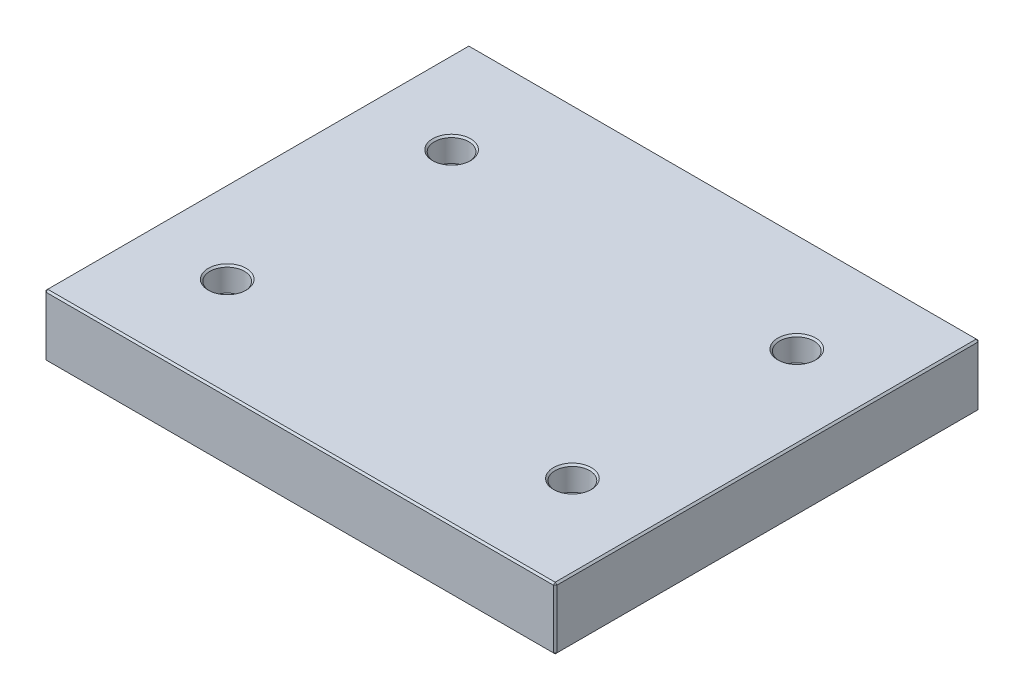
ISO-10303-21;
HEADER;
FILE_DESCRIPTION(('STEP AP214'),'2;1');
FILE_NAME('part.step','',(''),(''),'','','');
FILE_SCHEMA(('AUTOMOTIVE_DESIGN { 1 0 10303 214 1 1 1 1 }'));
ENDSEC;
DATA;
#1=APPLICATION_CONTEXT('core data for automotive mechanical design processes');
#2=APPLICATION_PROTOCOL_DEFINITION('international standard','automotive_design',2000,#1);
#3=PRODUCT_CONTEXT('',#1,'mechanical');
#4=PRODUCT('Part','Part','',(#3));
#5=PRODUCT_RELATED_PRODUCT_CATEGORY('part','',(#4));
#6=PRODUCT_DEFINITION_FORMATION('','',#4);
#7=PRODUCT_DEFINITION_CONTEXT('part definition',#1,'design');
#8=PRODUCT_DEFINITION('design','',#6,#7);
#9=PRODUCT_DEFINITION_SHAPE('','',#8);
#10=(LENGTH_UNIT() NAMED_UNIT(*) SI_UNIT(.MILLI.,.METRE.));
#11=(NAMED_UNIT(*) PLANE_ANGLE_UNIT() SI_UNIT($,.RADIAN.));
#12=(NAMED_UNIT(*) SI_UNIT($,.STERADIAN.) SOLID_ANGLE_UNIT());
#13=UNCERTAINTY_MEASURE_WITH_UNIT(LENGTH_MEASURE(1.E-05),#10,'distance_accuracy_value','');
#14=(GEOMETRIC_REPRESENTATION_CONTEXT(3) GLOBAL_UNCERTAINTY_ASSIGNED_CONTEXT((#13)) GLOBAL_UNIT_ASSIGNED_CONTEXT((#10,
#11,#12)) REPRESENTATION_CONTEXT('',''));
#15=CARTESIAN_POINT('',(0.,0.,0.));
#16=DIRECTION('',(0.,0.,1.));
#17=DIRECTION('',(1.,0.,0.));
#18=AXIS2_PLACEMENT_3D('',#15,#16,#17);
#19=CARTESIAN_POINT('',(-148.,36.,123.));
#20=DIRECTION('',(1.,0.,0.));
#21=DIRECTION('',(0.,0.,-1.));
#22=AXIS2_PLACEMENT_3D('',#19,#20,#21);
#23=PLANE('',#22);
#24=DIRECTION('',(0.,-1.,0.));
#25=VECTOR('',#24,1.);
#26=CARTESIAN_POINT('',(-148.,36.,-122.));
#27=LINE('',#26,#25);
#28=CARTESIAN_POINT('',(-148.,35.,-122.));
#29=VERTEX_POINT('',#28);
#30=CARTESIAN_POINT('',(-148.,1.,-122.));
#31=VERTEX_POINT('',#30);
#32=EDGE_CURVE('E115',#29,#31,#27,.T.);
#33=ORIENTED_EDGE('',*,*,#32,.T.);
#34=DIRECTION('',(0.,0.,1.));
#35=VECTOR('',#34,1.);
#36=CARTESIAN_POINT('',(-148.,1.,123.));
#37=LINE('',#36,#35);
#38=CARTESIAN_POINT('',(-148.,1.,122.));
#39=VERTEX_POINT('',#38);
#40=EDGE_CURVE('E111',#31,#39,#37,.T.);
#41=ORIENTED_EDGE('',*,*,#40,.T.);
#42=DIRECTION('',(0.,1.,0.));
#43=VECTOR('',#42,1.);
#44=CARTESIAN_POINT('',(-148.,36.,122.));
#45=LINE('',#44,#43);
#46=CARTESIAN_POINT('',(-148.,35.,122.));
#47=VERTEX_POINT('',#46);
#48=EDGE_CURVE('E104',#39,#47,#45,.T.);
#49=ORIENTED_EDGE('',*,*,#48,.T.);
#50=DIRECTION('',(0.,0.,-1.));
#51=VECTOR('',#50,1.);
#52=CARTESIAN_POINT('',(-148.,35.,-123.));
#53=LINE('',#52,#51);
#54=EDGE_CURVE('E108',#47,#29,#53,.T.);
#55=ORIENTED_EDGE('',*,*,#54,.T.);
#56=EDGE_LOOP('',(#33,#41,#49,#55));
#57=FACE_BOUND('',#56,.T.);
#58=ADVANCED_FACE('F16',(#57),#23,.F.);
#59=CARTESIAN_POINT('',(148.,36.,123.));
#60=DIRECTION('',(0.,0.,-1.));
#61=DIRECTION('',(-1.,0.,0.));
#62=AXIS2_PLACEMENT_3D('',#59,#60,#61);
#63=PLANE('',#62);
#64=DIRECTION('',(-1.,0.,0.));
#65=VECTOR('',#64,1.);
#66=CARTESIAN_POINT('',(-148.,35.,123.));
#67=LINE('',#66,#65);
#68=CARTESIAN_POINT('',(147.,35.,123.));
#69=VERTEX_POINT('',#68);
#70=CARTESIAN_POINT('',(-147.,35.,123.));
#71=VERTEX_POINT('',#70);
#72=EDGE_CURVE('E170',#69,#71,#67,.T.);
#73=ORIENTED_EDGE('',*,*,#72,.T.);
#74=DIRECTION('',(0.,-1.,0.));
#75=VECTOR('',#74,1.);
#76=CARTESIAN_POINT('',(-147.,36.,123.));
#77=LINE('',#76,#75);
#78=CARTESIAN_POINT('',(-147.,1.,123.));
#79=VERTEX_POINT('',#78);
#80=EDGE_CURVE('E123',#71,#79,#77,.T.);
#81=ORIENTED_EDGE('',*,*,#80,.T.);
#82=DIRECTION('',(1.,0.,0.));
#83=VECTOR('',#82,1.);
#84=CARTESIAN_POINT('',(148.,1.,123.));
#85=LINE('',#84,#83);
#86=CARTESIAN_POINT('',(147.,1.,123.));
#87=VERTEX_POINT('',#86);
#88=EDGE_CURVE('E174',#79,#87,#85,.T.);
#89=ORIENTED_EDGE('',*,*,#88,.T.);
#90=DIRECTION('',(0.,1.,0.));
#91=VECTOR('',#90,1.);
#92=CARTESIAN_POINT('',(147.,36.,123.));
#93=LINE('',#92,#91);
#94=EDGE_CURVE('E172',#87,#69,#93,.T.);
#95=ORIENTED_EDGE('',*,*,#94,.T.);
#96=EDGE_LOOP('',(#73,#81,#89,#95));
#97=FACE_BOUND('',#96,.T.);
#98=ADVANCED_FACE('F317',(#97),#63,.F.);
#99=CARTESIAN_POINT('',(148.,36.,123.));
#100=DIRECTION('',(-1.,0.,0.));
#101=DIRECTION('',(0.,0.,1.));
#102=AXIS2_PLACEMENT_3D('',#99,#100,#101);
#103=PLANE('',#102);
#104=DIRECTION('',(0.,0.,-1.));
#105=VECTOR('',#104,1.);
#106=CARTESIAN_POINT('',(148.,1.,123.));
#107=LINE('',#106,#105);
#108=CARTESIAN_POINT('',(148.,1.,122.));
#109=VERTEX_POINT('',#108);
#110=CARTESIAN_POINT('',(148.,1.,-122.));
#111=VERTEX_POINT('',#110);
#112=EDGE_CURVE('E165',#109,#111,#107,.T.);
#113=ORIENTED_EDGE('',*,*,#112,.T.);
#114=DIRECTION('',(0.,1.,0.));
#115=VECTOR('',#114,1.);
#116=CARTESIAN_POINT('',(148.,36.,-122.));
#117=LINE('',#116,#115);
#118=CARTESIAN_POINT('',(148.,35.,-122.));
#119=VERTEX_POINT('',#118);
#120=EDGE_CURVE('E167',#111,#119,#117,.T.);
#121=ORIENTED_EDGE('',*,*,#120,.T.);
#122=DIRECTION('',(0.,0.,1.));
#123=VECTOR('',#122,1.);
#124=CARTESIAN_POINT('',(148.,35.,123.));
#125=LINE('',#124,#123);
#126=CARTESIAN_POINT('',(148.,35.,122.));
#127=VERTEX_POINT('',#126);
#128=EDGE_CURVE('E161',#119,#127,#125,.T.);
#129=ORIENTED_EDGE('',*,*,#128,.T.);
#130=DIRECTION('',(0.,-1.,0.));
#131=VECTOR('',#130,1.);
#132=CARTESIAN_POINT('',(148.,36.,122.));
#133=LINE('',#132,#131);
#134=EDGE_CURVE('E163',#127,#109,#133,.T.);
#135=ORIENTED_EDGE('',*,*,#134,.T.);
#136=EDGE_LOOP('',(#113,#121,#129,#135));
#137=FACE_BOUND('',#136,.T.);
#138=ADVANCED_FACE('F323',(#137),#103,.F.);
#139=CARTESIAN_POINT('',(148.,36.,-123.));
#140=DIRECTION('',(0.,0.,1.));
#141=DIRECTION('',(1.,0.,0.));
#142=AXIS2_PLACEMENT_3D('',#139,#140,#141);
#143=PLANE('',#142);
#144=DIRECTION('',(0.,-1.,0.));
#145=VECTOR('',#144,1.);
#146=CARTESIAN_POINT('',(147.,36.,-123.));
#147=LINE('',#146,#145);
#148=CARTESIAN_POINT('',(147.,35.,-123.));
#149=VERTEX_POINT('',#148);
#150=CARTESIAN_POINT('',(147.,1.,-123.));
#151=VERTEX_POINT('',#150);
#152=EDGE_CURVE('E154',#149,#151,#147,.T.);
#153=ORIENTED_EDGE('',*,*,#152,.T.);
#154=DIRECTION('',(-1.,0.,0.));
#155=VECTOR('',#154,1.);
#156=CARTESIAN_POINT('',(148.,1.,-123.));
#157=LINE('',#156,#155);
#158=CARTESIAN_POINT('',(-147.,1.,-123.));
#159=VERTEX_POINT('',#158);
#160=EDGE_CURVE('E159',#151,#159,#157,.T.);
#161=ORIENTED_EDGE('',*,*,#160,.T.);
#162=DIRECTION('',(0.,1.,0.));
#163=VECTOR('',#162,1.);
#164=CARTESIAN_POINT('',(-147.,36.,-123.));
#165=LINE('',#164,#163);
#166=CARTESIAN_POINT('',(-147.,35.,-123.));
#167=VERTEX_POINT('',#166);
#168=EDGE_CURVE('E156',#159,#167,#165,.T.);
#169=ORIENTED_EDGE('',*,*,#168,.T.);
#170=DIRECTION('',(1.,0.,0.));
#171=VECTOR('',#170,1.);
#172=CARTESIAN_POINT('',(148.,35.,-123.));
#173=LINE('',#172,#171);
#174=EDGE_CURVE('E152',#167,#149,#173,.T.);
#175=ORIENTED_EDGE('',*,*,#174,.T.);
#176=EDGE_LOOP('',(#153,#161,#169,#175));
#177=FACE_BOUND('',#176,.T.);
#178=ADVANCED_FACE('F465',(#177),#143,.F.);
#179=CARTESIAN_POINT('',(0.,36.,0.));
#180=DIRECTION('',(0.,1.,0.));
#181=DIRECTION('',(0.,0.,1.));
#182=AXIS2_PLACEMENT_3D('',#179,#180,#181);
#183=PLANE('',#182);
#184=CARTESIAN_POINT('',(-100.,36.,65.));
#185=DIRECTION('',(0.,1.,0.));
#186=DIRECTION('',(0.,0.,1.));
#187=AXIS2_PLACEMENT_3D('',#184,#185,#186);
#188=CIRCLE('',#187,11.);
#189=CARTESIAN_POINT('',(-100.,36.,76.));
#190=VERTEX_POINT('',#189);
#191=EDGE_CURVE('E290',#190,#190,#188,.F.);
#192=ORIENTED_EDGE('',*,*,#191,.T.);
#193=EDGE_LOOP('',(#192));
#194=FACE_BOUND('',#193,.T.);
#195=CARTESIAN_POINT('',(100.,36.,65.));
#196=DIRECTION('',(0.,1.,0.));
#197=DIRECTION('',(0.,0.,1.));
#198=AXIS2_PLACEMENT_3D('',#195,#196,#197);
#199=CIRCLE('',#198,11.);
#200=CARTESIAN_POINT('',(100.,36.,76.));
#201=VERTEX_POINT('',#200);
#202=EDGE_CURVE('E287',#201,#201,#199,.F.);
#203=ORIENTED_EDGE('',*,*,#202,.T.);
#204=EDGE_LOOP('',(#203));
#205=FACE_BOUND('',#204,.T.);
#206=CARTESIAN_POINT('',(100.,36.,-65.));
#207=DIRECTION('',(0.,1.,0.));
#208=DIRECTION('',(0.,0.,1.));
#209=AXIS2_PLACEMENT_3D('',#206,#207,#208);
#210=CIRCLE('',#209,11.);
#211=CARTESIAN_POINT('',(100.,36.,-54.));
#212=VERTEX_POINT('',#211);
#213=EDGE_CURVE('E284',#212,#212,#210,.F.);
#214=ORIENTED_EDGE('',*,*,#213,.T.);
#215=EDGE_LOOP('',(#214));
#216=FACE_BOUND('',#215,.T.);
#217=CARTESIAN_POINT('',(-100.,36.,-65.));
#218=DIRECTION('',(0.,1.,0.));
#219=DIRECTION('',(0.,0.,1.));
#220=AXIS2_PLACEMENT_3D('',#217,#218,#219);
#221=CIRCLE('',#220,11.);
#222=CARTESIAN_POINT('',(-100.,36.,-54.));
#223=VERTEX_POINT('',#222);
#224=EDGE_CURVE('E281',#223,#223,#221,.F.);
#225=ORIENTED_EDGE('',*,*,#224,.T.);
#226=EDGE_LOOP('',(#225));
#227=FACE_BOUND('',#226,.T.);
#228=DIRECTION('',(0.,0.,-1.));
#229=VECTOR('',#228,1.);
#230=CARTESIAN_POINT('',(147.,36.,-123.));
#231=LINE('',#230,#229);
#232=CARTESIAN_POINT('',(147.,36.,122.));
#233=VERTEX_POINT('',#232);
#234=CARTESIAN_POINT('',(147.,36.,-122.));
#235=VERTEX_POINT('',#234);
#236=EDGE_CURVE('E31',#233,#235,#231,.T.);
#237=ORIENTED_EDGE('',*,*,#236,.T.);
#238=DIRECTION('',(-1.,0.,0.));
#239=VECTOR('',#238,1.);
#240=CARTESIAN_POINT('',(-148.,36.,-122.));
#241=LINE('',#240,#239);
#242=CARTESIAN_POINT('',(-147.,36.,-122.));
#243=VERTEX_POINT('',#242);
#244=EDGE_CURVE('E190',#235,#243,#241,.T.);
#245=ORIENTED_EDGE('',*,*,#244,.T.);
#246=DIRECTION('',(0.,0.,1.));
#247=VECTOR('',#246,1.);
#248=CARTESIAN_POINT('',(-147.,36.,123.));
#249=LINE('',#248,#247);
#250=CARTESIAN_POINT('',(-147.,36.,122.));
#251=VERTEX_POINT('',#250);
#252=EDGE_CURVE('E186',#243,#251,#249,.T.);
#253=ORIENTED_EDGE('',*,*,#252,.T.);
#254=DIRECTION('',(1.,0.,0.));
#255=VECTOR('',#254,1.);
#256=CARTESIAN_POINT('',(148.,36.,122.));
#257=LINE('',#256,#255);
#258=EDGE_CURVE('E36',#251,#233,#257,.T.);
#259=ORIENTED_EDGE('',*,*,#258,.T.);
#260=EDGE_LOOP('',(#237,#245,#253,#259));
#261=FACE_BOUND('',#260,.T.);
#262=ADVANCED_FACE('F462',(#194,#205,#216,#227,#261),#183,.T.);
#263=CARTESIAN_POINT('',(0.,0.,0.));
#264=DIRECTION('',(0.,1.,0.));
#265=DIRECTION('',(0.,0.,1.));
#266=AXIS2_PLACEMENT_3D('',#263,#264,#265);
#267=PLANE('',#266);
#268=CARTESIAN_POINT('',(100.,0.,-65.));
#269=DIRECTION('',(0.,1.,0.));
#270=DIRECTION('',(0.,0.,1.));
#271=AXIS2_PLACEMENT_3D('',#268,#269,#270);
#272=CIRCLE('',#271,8.);
#273=CARTESIAN_POINT('',(100.,0.,-57.));
#274=VERTEX_POINT('',#273);
#275=EDGE_CURVE('E263',#274,#274,#272,.T.);
#276=ORIENTED_EDGE('',*,*,#275,.T.);
#277=EDGE_LOOP('',(#276));
#278=FACE_BOUND('',#277,.T.);
#279=CARTESIAN_POINT('',(100.,0.,65.));
#280=DIRECTION('',(0.,1.,0.));
#281=DIRECTION('',(0.,0.,1.));
#282=AXIS2_PLACEMENT_3D('',#279,#280,#281);
#283=CIRCLE('',#282,8.);
#284=CARTESIAN_POINT('',(100.,0.,73.));
#285=VERTEX_POINT('',#284);
#286=EDGE_CURVE('E260',#285,#285,#283,.T.);
#287=ORIENTED_EDGE('',*,*,#286,.T.);
#288=EDGE_LOOP('',(#287));
#289=FACE_BOUND('',#288,.T.);
#290=CARTESIAN_POINT('',(-100.,0.,65.));
#291=DIRECTION('',(0.,1.,0.));
#292=DIRECTION('',(0.,0.,1.));
#293=AXIS2_PLACEMENT_3D('',#290,#291,#292);
#294=CIRCLE('',#293,8.);
#295=CARTESIAN_POINT('',(-100.,0.,73.));
#296=VERTEX_POINT('',#295);
#297=EDGE_CURVE('E257',#296,#296,#294,.T.);
#298=ORIENTED_EDGE('',*,*,#297,.T.);
#299=EDGE_LOOP('',(#298));
#300=FACE_BOUND('',#299,.T.);
#301=CARTESIAN_POINT('',(-100.,0.,-65.));
#302=DIRECTION('',(0.,1.,0.));
#303=DIRECTION('',(0.,0.,1.));
#304=AXIS2_PLACEMENT_3D('',#301,#302,#303);
#305=CIRCLE('',#304,8.);
#306=CARTESIAN_POINT('',(-100.,0.,-57.));
#307=VERTEX_POINT('',#306);
#308=EDGE_CURVE('E192',#307,#307,#305,.T.);
#309=ORIENTED_EDGE('',*,*,#308,.T.);
#310=EDGE_LOOP('',(#309));
#311=FACE_BOUND('',#310,.T.);
#312=DIRECTION('',(0.,0.,1.));
#313=VECTOR('',#312,1.);
#314=CARTESIAN_POINT('',(147.,0.,0.));
#315=LINE('',#314,#313);
#316=CARTESIAN_POINT('',(147.,0.,-122.));
#317=VERTEX_POINT('',#316);
#318=CARTESIAN_POINT('',(147.,0.,122.));
#319=VERTEX_POINT('',#318);
#320=EDGE_CURVE('E177',#317,#319,#315,.T.);
#321=ORIENTED_EDGE('',*,*,#320,.T.);
#322=DIRECTION('',(-1.,0.,0.));
#323=VECTOR('',#322,1.);
#324=CARTESIAN_POINT('',(0.,0.,122.));
#325=LINE('',#324,#323);
#326=CARTESIAN_POINT('',(-147.,0.,122.));
#327=VERTEX_POINT('',#326);
#328=EDGE_CURVE('E183',#319,#327,#325,.T.);
#329=ORIENTED_EDGE('',*,*,#328,.T.);
#330=DIRECTION('',(0.,0.,-1.));
#331=VECTOR('',#330,1.);
#332=CARTESIAN_POINT('',(-147.,0.,0.));
#333=LINE('',#332,#331);
#334=CARTESIAN_POINT('',(-147.,0.,-122.));
#335=VERTEX_POINT('',#334);
#336=EDGE_CURVE('E181',#327,#335,#333,.T.);
#337=ORIENTED_EDGE('',*,*,#336,.T.);
#338=DIRECTION('',(1.,0.,0.));
#339=VECTOR('',#338,1.);
#340=CARTESIAN_POINT('',(0.,0.,-122.));
#341=LINE('',#340,#339);
#342=EDGE_CURVE('E179',#335,#317,#341,.T.);
#343=ORIENTED_EDGE('',*,*,#342,.T.);
#344=EDGE_LOOP('',(#321,#329,#337,#343));
#345=FACE_BOUND('',#344,.T.);
#346=ADVANCED_FACE('F402',(#278,#289,#300,#311,#345),#267,.F.);
#347=CARTESIAN_POINT('',(148.,36.,122.));
#348=DIRECTION('',(-0.707106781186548,0.,-0.707106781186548));
#349=DIRECTION('',(0.,-1.,0.));
#350=AXIS2_PLACEMENT_3D('',#347,#348,#349);
#351=PLANE('',#350);
#352=DIRECTION('',(-0.707106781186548,0.,0.707106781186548));
#353=VECTOR('',#352,1.);
#354=CARTESIAN_POINT('',(147.,35.,123.));
#355=LINE('',#354,#353);
#356=EDGE_CURVE('E141',#69,#127,#355,.F.);
#357=ORIENTED_EDGE('',*,*,#356,.F.);
#358=ORIENTED_EDGE('',*,*,#94,.F.);
#359=DIRECTION('',(0.707106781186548,0.,-0.707106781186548));
#360=VECTOR('',#359,1.);
#361=CARTESIAN_POINT('',(147.,1.,123.));
#362=LINE('',#361,#360);
#363=EDGE_CURVE('E144',#109,#87,#362,.F.);
#364=ORIENTED_EDGE('',*,*,#363,.F.);
#365=ORIENTED_EDGE('',*,*,#134,.F.);
#366=EDGE_LOOP('',(#357,#358,#364,#365));
#367=FACE_BOUND('',#366,.T.);
#368=ADVANCED_FACE('F398',(#367),#351,.F.);
#369=CARTESIAN_POINT('',(147.,35.,123.));
#370=DIRECTION('',(0.577350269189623,0.577350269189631,0.577350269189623));
#371=DIRECTION('',(0.,-0.707106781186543,0.707106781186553));
#372=AXIS2_PLACEMENT_3D('',#369,#370,#371);
#373=PLANE('',#372);
#374=DIRECTION('',(0.,-0.70710678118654,0.707106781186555));
#375=VECTOR('',#374,1.);
#376=CARTESIAN_POINT('',(147.,35.,123.));
#377=LINE('',#376,#375);
#378=EDGE_CURVE('E235',#69,#233,#377,.F.);
#379=ORIENTED_EDGE('',*,*,#378,.F.);
#380=ORIENTED_EDGE('',*,*,#356,.T.);
#381=DIRECTION('',(-0.707106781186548,0.707106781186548,0.));
#382=VECTOR('',#381,1.);
#383=CARTESIAN_POINT('',(147.5,35.5,122.));
#384=LINE('',#383,#382);
#385=EDGE_CURVE('E237',#233,#127,#384,.F.);
#386=ORIENTED_EDGE('',*,*,#385,.F.);
#387=EDGE_LOOP('',(#379,#380,#386));
#388=FACE_BOUND('',#387,.T.);
#389=ADVANCED_FACE('F394',(#388),#373,.T.);
#390=CARTESIAN_POINT('',(147.,1.,123.));
#391=DIRECTION('',(0.577350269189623,-0.577350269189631,0.577350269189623));
#392=DIRECTION('',(0.,-0.707106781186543,-0.707106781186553));
#393=AXIS2_PLACEMENT_3D('',#390,#391,#392);
#394=PLANE('',#393);
#395=DIRECTION('',(-0.707106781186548,-0.707106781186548,0.));
#396=VECTOR('',#395,1.);
#397=CARTESIAN_POINT('',(147.5,0.500000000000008,122.));
#398=LINE('',#397,#396);
#399=EDGE_CURVE('E229',#109,#319,#398,.T.);
#400=ORIENTED_EDGE('',*,*,#399,.F.);
#401=ORIENTED_EDGE('',*,*,#363,.T.);
#402=DIRECTION('',(0.,0.70710678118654,0.707106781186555));
#403=VECTOR('',#402,1.);
#404=CARTESIAN_POINT('',(147.,1.,123.));
#405=LINE('',#404,#403);
#406=EDGE_CURVE('E232',#319,#87,#405,.T.);
#407=ORIENTED_EDGE('',*,*,#406,.F.);
#408=EDGE_LOOP('',(#400,#401,#407));
#409=FACE_BOUND('',#408,.T.);
#410=ADVANCED_FACE('F390',(#409),#394,.T.);
#411=CARTESIAN_POINT('',(147.,36.,0.));
#412=DIRECTION('',(0.707106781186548,0.707106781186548,0.));
#413=DIRECTION('',(0.,0.,1.));
#414=AXIS2_PLACEMENT_3D('',#411,#412,#413);
#415=PLANE('',#414);
#416=ORIENTED_EDGE('',*,*,#385,.T.);
#417=ORIENTED_EDGE('',*,*,#128,.F.);
#418=DIRECTION('',(0.707106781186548,-0.707106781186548,0.));
#419=VECTOR('',#418,1.);
#420=CARTESIAN_POINT('',(148.,35.,-122.));
#421=LINE('',#420,#419);
#422=EDGE_CURVE('E224',#235,#119,#421,.T.);
#423=ORIENTED_EDGE('',*,*,#422,.F.);
#424=ORIENTED_EDGE('',*,*,#236,.F.);
#425=EDGE_LOOP('',(#416,#417,#423,#424));
#426=FACE_BOUND('',#425,.T.);
#427=ADVANCED_FACE('F386',(#426),#415,.T.);
#428=CARTESIAN_POINT('',(0.,36.,122.));
#429=DIRECTION('',(0.,0.707106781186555,0.70710678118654));
#430=DIRECTION('',(-1.,0.,0.));
#431=AXIS2_PLACEMENT_3D('',#428,#429,#430);
#432=PLANE('',#431);
#433=ORIENTED_EDGE('',*,*,#378,.T.);
#434=ORIENTED_EDGE('',*,*,#258,.F.);
#435=DIRECTION('',(0.,0.70710678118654,-0.707106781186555));
#436=VECTOR('',#435,1.);
#437=CARTESIAN_POINT('',(-147.,35.5,122.5));
#438=LINE('',#437,#436);
#439=EDGE_CURVE('E127',#71,#251,#438,.T.);
#440=ORIENTED_EDGE('',*,*,#439,.F.);
#441=ORIENTED_EDGE('',*,*,#72,.F.);
#442=EDGE_LOOP('',(#433,#434,#440,#441));
#443=FACE_BOUND('',#442,.T.);
#444=ADVANCED_FACE('F383',(#443),#432,.T.);
#445=CARTESIAN_POINT('',(-147.,36.,123.));
#446=DIRECTION('',(0.707106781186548,0.,-0.707106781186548));
#447=DIRECTION('',(0.,-1.,0.));
#448=AXIS2_PLACEMENT_3D('',#445,#446,#447);
#449=PLANE('',#448);
#450=DIRECTION('',(0.707106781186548,0.,0.707106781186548));
#451=VECTOR('',#450,1.);
#452=CARTESIAN_POINT('',(-147.,1.,123.));
#453=LINE('',#452,#451);
#454=EDGE_CURVE('E128',#79,#39,#453,.F.);
#455=ORIENTED_EDGE('',*,*,#454,.F.);
#456=ORIENTED_EDGE('',*,*,#80,.F.);
#457=DIRECTION('',(-0.707106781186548,0.,-0.707106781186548));
#458=VECTOR('',#457,1.);
#459=CARTESIAN_POINT('',(-148.,35.,122.));
#460=LINE('',#459,#458);
#461=EDGE_CURVE('E119',#47,#71,#460,.F.);
#462=ORIENTED_EDGE('',*,*,#461,.F.);
#463=ORIENTED_EDGE('',*,*,#48,.F.);
#464=EDGE_LOOP('',(#455,#456,#462,#463));
#465=FACE_BOUND('',#464,.T.);
#466=ADVANCED_FACE('F121',(#465),#449,.F.);
#467=CARTESIAN_POINT('',(148.,1.,123.));
#468=DIRECTION('',(0.,0.707106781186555,-0.70710678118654));
#469=DIRECTION('',(1.,0.,0.));
#470=AXIS2_PLACEMENT_3D('',#467,#468,#469);
#471=PLANE('',#470);
#472=ORIENTED_EDGE('',*,*,#406,.T.);
#473=ORIENTED_EDGE('',*,*,#88,.F.);
#474=DIRECTION('',(0.,-0.70710678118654,-0.707106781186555));
#475=VECTOR('',#474,1.);
#476=CARTESIAN_POINT('',(-147.,1.,123.));
#477=LINE('',#476,#475);
#478=EDGE_CURVE('E220',#327,#79,#477,.F.);
#479=ORIENTED_EDGE('',*,*,#478,.F.);
#480=ORIENTED_EDGE('',*,*,#328,.F.);
#481=EDGE_LOOP('',(#472,#473,#479,#480));
#482=FACE_BOUND('',#481,.T.);
#483=ADVANCED_FACE('F376',(#482),#471,.F.);
#484=CARTESIAN_POINT('',(148.,1.,123.));
#485=DIRECTION('',(-0.707106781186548,0.707106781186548,0.));
#486=DIRECTION('',(0.,0.,-1.));
#487=AXIS2_PLACEMENT_3D('',#484,#485,#486);
#488=PLANE('',#487);
#489=ORIENTED_EDGE('',*,*,#399,.T.);
#490=ORIENTED_EDGE('',*,*,#320,.F.);
#491=DIRECTION('',(0.707106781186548,0.707106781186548,0.));
#492=VECTOR('',#491,1.);
#493=CARTESIAN_POINT('',(147.5,0.499999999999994,-122.));
#494=LINE('',#493,#492);
#495=EDGE_CURVE('E217',#111,#317,#494,.F.);
#496=ORIENTED_EDGE('',*,*,#495,.F.);
#497=ORIENTED_EDGE('',*,*,#112,.F.);
#498=EDGE_LOOP('',(#489,#490,#496,#497));
#499=FACE_BOUND('',#498,.T.);
#500=ADVANCED_FACE('F372',(#499),#488,.F.);
#501=CARTESIAN_POINT('',(147.,36.,-123.));
#502=DIRECTION('',(-0.707106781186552,0.,0.707106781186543));
#503=DIRECTION('',(0.,-1.,0.));
#504=AXIS2_PLACEMENT_3D('',#501,#502,#503);
#505=PLANE('',#504);
#506=DIRECTION('',(0.707106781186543,0.,0.707106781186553));
#507=VECTOR('',#506,1.);
#508=CARTESIAN_POINT('',(148.,35.,-122.));
#509=LINE('',#508,#507);
#510=EDGE_CURVE('E226',#119,#149,#509,.F.);
#511=ORIENTED_EDGE('',*,*,#510,.F.);
#512=ORIENTED_EDGE('',*,*,#120,.F.);
#513=DIRECTION('',(-0.707106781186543,0.,-0.707106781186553));
#514=VECTOR('',#513,1.);
#515=CARTESIAN_POINT('',(147.,1.,-123.));
#516=LINE('',#515,#514);
#517=EDGE_CURVE('E214',#151,#111,#516,.F.);
#518=ORIENTED_EDGE('',*,*,#517,.F.);
#519=ORIENTED_EDGE('',*,*,#152,.F.);
#520=EDGE_LOOP('',(#511,#512,#518,#519));
#521=FACE_BOUND('',#520,.T.);
#522=ADVANCED_FACE('F368',(#521),#505,.F.);
#523=CARTESIAN_POINT('',(148.,35.,-122.));
#524=DIRECTION('',(0.577350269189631,0.577350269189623,-0.577350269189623));
#525=DIRECTION('',(-0.707106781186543,0.,-0.707106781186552));
#526=AXIS2_PLACEMENT_3D('',#523,#524,#525);
#527=PLANE('',#526);
#528=ORIENTED_EDGE('',*,*,#422,.T.);
#529=ORIENTED_EDGE('',*,*,#510,.T.);
#530=DIRECTION('',(0.,0.707106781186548,0.707106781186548));
#531=VECTOR('',#530,1.);
#532=CARTESIAN_POINT('',(147.,35.5,-122.5));
#533=LINE('',#532,#531);
#534=EDGE_CURVE('E135',#235,#149,#533,.F.);
#535=ORIENTED_EDGE('',*,*,#534,.F.);
#536=EDGE_LOOP('',(#528,#529,#535));
#537=FACE_BOUND('',#536,.T.);
#538=ADVANCED_FACE('F365',(#537),#527,.T.);
#539=CARTESIAN_POINT('',(-148.,35.,122.));
#540=DIRECTION('',(-0.577350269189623,0.577350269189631,0.577350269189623));
#541=DIRECTION('',(0.,-0.707106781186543,0.707106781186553));
#542=AXIS2_PLACEMENT_3D('',#539,#540,#541);
#543=PLANE('',#542);
#544=ORIENTED_EDGE('',*,*,#461,.T.);
#545=ORIENTED_EDGE('',*,*,#439,.T.);
#546=DIRECTION('',(-0.707106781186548,-0.707106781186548,0.));
#547=VECTOR('',#546,1.);
#548=CARTESIAN_POINT('',(-148.,35.,122.));
#549=LINE('',#548,#547);
#550=EDGE_CURVE('E131',#47,#251,#549,.F.);
#551=ORIENTED_EDGE('',*,*,#550,.F.);
#552=EDGE_LOOP('',(#544,#545,#551));
#553=FACE_BOUND('',#552,.T.);
#554=ADVANCED_FACE('F132',(#553),#543,.T.);
#555=CARTESIAN_POINT('',(-147.,1.,123.));
#556=DIRECTION('',(-0.577350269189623,-0.577350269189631,0.577350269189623));
#557=DIRECTION('',(0.,-0.707106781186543,-0.707106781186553));
#558=AXIS2_PLACEMENT_3D('',#555,#556,#557);
#559=PLANE('',#558);
#560=ORIENTED_EDGE('',*,*,#478,.T.);
#561=ORIENTED_EDGE('',*,*,#454,.T.);
#562=DIRECTION('',(-0.707106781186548,0.707106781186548,0.));
#563=VECTOR('',#562,1.);
#564=CARTESIAN_POINT('',(-147.5,0.500000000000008,122.));
#565=LINE('',#564,#563);
#566=EDGE_CURVE('E136',#327,#39,#565,.T.);
#567=ORIENTED_EDGE('',*,*,#566,.F.);
#568=EDGE_LOOP('',(#560,#561,#567));
#569=FACE_BOUND('',#568,.T.);
#570=ADVANCED_FACE('F358',(#569),#559,.T.);
#571=CARTESIAN_POINT('',(147.,1.,-123.));
#572=DIRECTION('',(0.577350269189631,-0.577350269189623,-0.577350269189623));
#573=DIRECTION('',(-0.707106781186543,0.,-0.707106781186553));
#574=AXIS2_PLACEMENT_3D('',#571,#572,#573);
#575=PLANE('',#574);
#576=ORIENTED_EDGE('',*,*,#517,.T.);
#577=ORIENTED_EDGE('',*,*,#495,.T.);
#578=DIRECTION('',(0.,-0.707106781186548,0.707106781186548));
#579=VECTOR('',#578,1.);
#580=CARTESIAN_POINT('',(147.,1.,-123.));
#581=LINE('',#580,#579);
#582=EDGE_CURVE('E207',#151,#317,#581,.T.);
#583=ORIENTED_EDGE('',*,*,#582,.F.);
#584=EDGE_LOOP('',(#576,#577,#583));
#585=FACE_BOUND('',#584,.T.);
#586=ADVANCED_FACE('F354',(#585),#575,.T.);
#587=CARTESIAN_POINT('',(0.,36.,-122.));
#588=DIRECTION('',(0.,0.707106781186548,-0.707106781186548));
#589=DIRECTION('',(1.,0.,0.));
#590=AXIS2_PLACEMENT_3D('',#587,#588,#589);
#591=PLANE('',#590);
#592=ORIENTED_EDGE('',*,*,#534,.T.);
#593=ORIENTED_EDGE('',*,*,#174,.F.);
#594=DIRECTION('',(0.,-0.707106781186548,-0.707106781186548));
#595=VECTOR('',#594,1.);
#596=CARTESIAN_POINT('',(-147.,35.,-123.));
#597=LINE('',#596,#595);
#598=EDGE_CURVE('E204',#243,#167,#597,.T.);
#599=ORIENTED_EDGE('',*,*,#598,.F.);
#600=ORIENTED_EDGE('',*,*,#244,.F.);
#601=EDGE_LOOP('',(#592,#593,#599,#600));
#602=FACE_BOUND('',#601,.T.);
#603=ADVANCED_FACE('F351',(#602),#591,.T.);
#604=CARTESIAN_POINT('',(-147.,36.,0.));
#605=DIRECTION('',(-0.707106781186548,0.707106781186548,0.));
#606=DIRECTION('',(0.,0.,-1.));
#607=AXIS2_PLACEMENT_3D('',#604,#605,#606);
#608=PLANE('',#607);
#609=ORIENTED_EDGE('',*,*,#550,.T.);
#610=ORIENTED_EDGE('',*,*,#252,.F.);
#611=DIRECTION('',(0.707106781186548,0.707106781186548,0.));
#612=VECTOR('',#611,1.);
#613=CARTESIAN_POINT('',(-147.5,35.5,-122.));
#614=LINE('',#613,#612);
#615=EDGE_CURVE('E139',#29,#243,#614,.T.);
#616=ORIENTED_EDGE('',*,*,#615,.F.);
#617=ORIENTED_EDGE('',*,*,#54,.F.);
#618=EDGE_LOOP('',(#609,#610,#616,#617));
#619=FACE_BOUND('',#618,.T.);
#620=ADVANCED_FACE('F138',(#619),#608,.T.);
#621=CARTESIAN_POINT('',(-148.,1.,123.));
#622=DIRECTION('',(0.707106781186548,0.707106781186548,0.));
#623=DIRECTION('',(0.,0.,1.));
#624=AXIS2_PLACEMENT_3D('',#621,#622,#623);
#625=PLANE('',#624);
#626=ORIENTED_EDGE('',*,*,#566,.T.);
#627=ORIENTED_EDGE('',*,*,#40,.F.);
#628=DIRECTION('',(0.707106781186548,-0.707106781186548,0.));
#629=VECTOR('',#628,1.);
#630=CARTESIAN_POINT('',(-148.,1.,-122.));
#631=LINE('',#630,#629);
#632=EDGE_CURVE('E200',#335,#31,#631,.F.);
#633=ORIENTED_EDGE('',*,*,#632,.F.);
#634=ORIENTED_EDGE('',*,*,#336,.F.);
#635=EDGE_LOOP('',(#626,#627,#633,#634));
#636=FACE_BOUND('',#635,.T.);
#637=ADVANCED_FACE('F344',(#636),#625,.F.);
#638=CARTESIAN_POINT('',(148.,1.,-123.));
#639=DIRECTION('',(0.,0.707106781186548,0.707106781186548));
#640=DIRECTION('',(-1.,0.,0.));
#641=AXIS2_PLACEMENT_3D('',#638,#639,#640);
#642=PLANE('',#641);
#643=ORIENTED_EDGE('',*,*,#582,.T.);
#644=ORIENTED_EDGE('',*,*,#342,.F.);
#645=DIRECTION('',(0.,0.707106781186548,-0.707106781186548));
#646=VECTOR('',#645,1.);
#647=CARTESIAN_POINT('',(-147.,0.5,-122.5));
#648=LINE('',#647,#646);
#649=EDGE_CURVE('E197',#159,#335,#648,.F.);
#650=ORIENTED_EDGE('',*,*,#649,.F.);
#651=ORIENTED_EDGE('',*,*,#160,.F.);
#652=EDGE_LOOP('',(#643,#644,#650,#651));
#653=FACE_BOUND('',#652,.T.);
#654=ADVANCED_FACE('F340',(#653),#642,.F.);
#655=CARTESIAN_POINT('',(-147.,35.,-123.));
#656=DIRECTION('',(-0.577350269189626,0.577350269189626,-0.577350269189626));
#657=DIRECTION('',(-0.707106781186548,0.,0.707106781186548));
#658=AXIS2_PLACEMENT_3D('',#655,#656,#657);
#659=PLANE('',#658);
#660=ORIENTED_EDGE('',*,*,#615,.T.);
#661=ORIENTED_EDGE('',*,*,#598,.T.);
#662=DIRECTION('',(0.707106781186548,0.,-0.707106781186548));
#663=VECTOR('',#662,1.);
#664=CARTESIAN_POINT('',(-147.,35.,-123.));
#665=LINE('',#664,#663);
#666=EDGE_CURVE('E195',#29,#167,#665,.T.);
#667=ORIENTED_EDGE('',*,*,#666,.F.);
#668=EDGE_LOOP('',(#660,#661,#667));
#669=FACE_BOUND('',#668,.T.);
#670=ADVANCED_FACE('F336',(#669),#659,.T.);
#671=CARTESIAN_POINT('',(-148.,1.,-122.));
#672=DIRECTION('',(-0.577350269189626,-0.577350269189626,-0.577350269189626));
#673=DIRECTION('',(-0.707106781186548,0.,0.707106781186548));
#674=AXIS2_PLACEMENT_3D('',#671,#672,#673);
#675=PLANE('',#674);
#676=ORIENTED_EDGE('',*,*,#649,.T.);
#677=ORIENTED_EDGE('',*,*,#632,.T.);
#678=DIRECTION('',(-0.707106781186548,0.,0.707106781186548));
#679=VECTOR('',#678,1.);
#680=CARTESIAN_POINT('',(-148.,1.,-122.));
#681=LINE('',#680,#679);
#682=EDGE_CURVE('E193',#159,#31,#681,.T.);
#683=ORIENTED_EDGE('',*,*,#682,.F.);
#684=EDGE_LOOP('',(#676,#677,#683));
#685=FACE_BOUND('',#684,.T.);
#686=ADVANCED_FACE('F332',(#685),#675,.T.);
#687=CARTESIAN_POINT('',(-148.,36.,-122.));
#688=DIRECTION('',(0.707106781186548,0.,0.707106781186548));
#689=DIRECTION('',(0.,-1.,0.));
#690=AXIS2_PLACEMENT_3D('',#687,#688,#689);
#691=PLANE('',#690);
#692=ORIENTED_EDGE('',*,*,#666,.T.);
#693=ORIENTED_EDGE('',*,*,#168,.F.);
#694=ORIENTED_EDGE('',*,*,#682,.T.);
#695=ORIENTED_EDGE('',*,*,#32,.F.);
#696=EDGE_LOOP('',(#692,#693,#694,#695));
#697=FACE_BOUND('',#696,.T.);
#698=ADVANCED_FACE('F328',(#697),#691,.F.);
#699=CARTESIAN_POINT('',(-100.,22.,-65.));
#700=DIRECTION('',(0.,1.,0.));
#701=DIRECTION('',(0.,0.,1.));
#702=AXIS2_PLACEMENT_3D('',#699,#700,#701);
#703=CYLINDRICAL_SURFACE('',#702,10.);
#704=CARTESIAN_POINT('',(-100.,35.,-65.));
#705=DIRECTION('',(0.,1.,0.));
#706=DIRECTION('',(0.,0.,1.));
#707=AXIS2_PLACEMENT_3D('',#704,#705,#706);
#708=CIRCLE('',#707,10.);
#709=CARTESIAN_POINT('',(-100.,35.,-55.));
#710=VERTEX_POINT('',#709);
#711=EDGE_CURVE('E10',#710,#710,#708,.T.);
#712=ORIENTED_EDGE('',*,*,#711,.T.);
#713=EDGE_LOOP('',(#712));
#714=FACE_BOUND('',#713,.T.);
#715=CARTESIAN_POINT('',(-100.,22.,-65.));
#716=DIRECTION('',(0.,1.,0.));
#717=DIRECTION('',(0.,0.,1.));
#718=AXIS2_PLACEMENT_3D('',#715,#716,#717);
#719=CIRCLE('',#718,10.);
#720=CARTESIAN_POINT('',(-100.,22.,-55.));
#721=VERTEX_POINT('',#720);
#722=EDGE_CURVE('E147',#721,#721,#719,.T.);
#723=ORIENTED_EDGE('',*,*,#722,.F.);
#724=EDGE_LOOP('',(#723));
#725=FACE_BOUND('',#724,.T.);
#726=ADVANCED_FACE('F331',(#714,#725),#703,.F.);
#727=CARTESIAN_POINT('',(-100.,22.,-65.));
#728=DIRECTION('',(0.,1.,0.));
#729=DIRECTION('',(0.,0.,1.));
#730=AXIS2_PLACEMENT_3D('',#727,#728,#729);
#731=PLANE('',#730);
#732=CARTESIAN_POINT('',(-100.,22.,-65.));
#733=DIRECTION('',(0.,1.,0.));
#734=DIRECTION('',(0.,0.,1.));
#735=AXIS2_PLACEMENT_3D('',#732,#733,#734);
#736=CIRCLE('',#735,7.);
#737=CARTESIAN_POINT('',(-100.,22.,-58.));
#738=VERTEX_POINT('',#737);
#739=EDGE_CURVE('E251',#738,#738,#736,.T.);
#740=ORIENTED_EDGE('',*,*,#739,.F.);
#741=EDGE_LOOP('',(#740));
#742=FACE_BOUND('',#741,.T.);
#743=ORIENTED_EDGE('',*,*,#722,.T.);
#744=EDGE_LOOP('',(#743));
#745=FACE_BOUND('',#744,.T.);
#746=ADVANCED_FACE('F450',(#742,#745),#731,.T.);
#747=CARTESIAN_POINT('',(100.,22.,-65.));
#748=DIRECTION('',(0.,1.,0.));
#749=DIRECTION('',(0.,0.,1.));
#750=AXIS2_PLACEMENT_3D('',#747,#748,#749);
#751=CYLINDRICAL_SURFACE('',#750,10.);
#752=CARTESIAN_POINT('',(100.,35.,-65.));
#753=DIRECTION('',(0.,1.,0.));
#754=DIRECTION('',(0.,0.,1.));
#755=AXIS2_PLACEMENT_3D('',#752,#753,#754);
#756=CIRCLE('',#755,10.);
#757=CARTESIAN_POINT('',(100.,35.,-55.));
#758=VERTEX_POINT('',#757);
#759=EDGE_CURVE('E24',#758,#758,#756,.T.);
#760=ORIENTED_EDGE('',*,*,#759,.T.);
#761=EDGE_LOOP('',(#760));
#762=FACE_BOUND('',#761,.T.);
#763=CARTESIAN_POINT('',(100.,22.,-65.));
#764=DIRECTION('',(0.,1.,0.));
#765=DIRECTION('',(0.,0.,1.));
#766=AXIS2_PLACEMENT_3D('',#763,#764,#765);
#767=CIRCLE('',#766,10.);
#768=CARTESIAN_POINT('',(100.,22.,-55.));
#769=VERTEX_POINT('',#768);
#770=EDGE_CURVE('E441',#769,#769,#767,.T.);
#771=ORIENTED_EDGE('',*,*,#770,.F.);
#772=EDGE_LOOP('',(#771));
#773=FACE_BOUND('',#772,.T.);
#774=ADVANCED_FACE('F298',(#762,#773),#751,.F.);
#775=CARTESIAN_POINT('',(100.,22.,-65.));
#776=DIRECTION('',(0.,1.,0.));
#777=DIRECTION('',(0.,0.,1.));
#778=AXIS2_PLACEMENT_3D('',#775,#776,#777);
#779=PLANE('',#778);
#780=CARTESIAN_POINT('',(100.,22.,-65.));
#781=DIRECTION('',(0.,1.,0.));
#782=DIRECTION('',(0.,0.,1.));
#783=AXIS2_PLACEMENT_3D('',#780,#781,#782);
#784=CIRCLE('',#783,7.);
#785=CARTESIAN_POINT('',(100.,22.,-58.));
#786=VERTEX_POINT('',#785);
#787=EDGE_CURVE('E248',#786,#786,#784,.T.);
#788=ORIENTED_EDGE('',*,*,#787,.F.);
#789=EDGE_LOOP('',(#788));
#790=FACE_BOUND('',#789,.T.);
#791=ORIENTED_EDGE('',*,*,#770,.T.);
#792=EDGE_LOOP('',(#791));
#793=FACE_BOUND('',#792,.T.);
#794=ADVANCED_FACE('F738',(#790,#793),#779,.T.);
#795=CARTESIAN_POINT('',(100.,22.,65.));
#796=DIRECTION('',(0.,1.,0.));
#797=DIRECTION('',(0.,0.,1.));
#798=AXIS2_PLACEMENT_3D('',#795,#796,#797);
#799=CYLINDRICAL_SURFACE('',#798,10.);
#800=CARTESIAN_POINT('',(100.,35.,65.));
#801=DIRECTION('',(0.,1.,0.));
#802=DIRECTION('',(0.,0.,1.));
#803=AXIS2_PLACEMENT_3D('',#800,#801,#802);
#804=CIRCLE('',#803,10.);
#805=CARTESIAN_POINT('',(100.,35.,75.));
#806=VERTEX_POINT('',#805);
#807=EDGE_CURVE('E293',#806,#806,#804,.T.);
#808=ORIENTED_EDGE('',*,*,#807,.T.);
#809=EDGE_LOOP('',(#808));
#810=FACE_BOUND('',#809,.T.);
#811=CARTESIAN_POINT('',(100.,22.,65.));
#812=DIRECTION('',(0.,1.,0.));
#813=DIRECTION('',(0.,0.,1.));
#814=AXIS2_PLACEMENT_3D('',#811,#812,#813);
#815=CIRCLE('',#814,10.);
#816=CARTESIAN_POINT('',(100.,22.,75.));
#817=VERTEX_POINT('',#816);
#818=EDGE_CURVE('E439',#817,#817,#815,.T.);
#819=ORIENTED_EDGE('',*,*,#818,.F.);
#820=EDGE_LOOP('',(#819));
#821=FACE_BOUND('',#820,.T.);
#822=ADVANCED_FACE('F730',(#810,#821),#799,.F.);
#823=CARTESIAN_POINT('',(100.,22.,65.));
#824=DIRECTION('',(0.,1.,0.));
#825=DIRECTION('',(0.,0.,1.));
#826=AXIS2_PLACEMENT_3D('',#823,#824,#825);
#827=PLANE('',#826);
#828=CARTESIAN_POINT('',(100.,22.,65.));
#829=DIRECTION('',(0.,1.,0.));
#830=DIRECTION('',(0.,0.,1.));
#831=AXIS2_PLACEMENT_3D('',#828,#829,#830);
#832=CIRCLE('',#831,7.);
#833=CARTESIAN_POINT('',(100.,22.,72.));
#834=VERTEX_POINT('',#833);
#835=EDGE_CURVE('E245',#834,#834,#832,.T.);
#836=ORIENTED_EDGE('',*,*,#835,.F.);
#837=EDGE_LOOP('',(#836));
#838=FACE_BOUND('',#837,.T.);
#839=ORIENTED_EDGE('',*,*,#818,.T.);
#840=EDGE_LOOP('',(#839));
#841=FACE_BOUND('',#840,.T.);
#842=ADVANCED_FACE('F434',(#838,#841),#827,.T.);
#843=CARTESIAN_POINT('',(-100.,22.,65.));
#844=DIRECTION('',(0.,1.,0.));
#845=DIRECTION('',(0.,0.,1.));
#846=AXIS2_PLACEMENT_3D('',#843,#844,#845);
#847=CYLINDRICAL_SURFACE('',#846,10.);
#848=CARTESIAN_POINT('',(-100.,35.,65.));
#849=DIRECTION('',(0.,1.,0.));
#850=DIRECTION('',(0.,0.,1.));
#851=AXIS2_PLACEMENT_3D('',#848,#849,#850);
#852=CIRCLE('',#851,10.);
#853=CARTESIAN_POINT('',(-100.,35.,75.));
#854=VERTEX_POINT('',#853);
#855=EDGE_CURVE('E278',#854,#854,#852,.T.);
#856=ORIENTED_EDGE('',*,*,#855,.T.);
#857=EDGE_LOOP('',(#856));
#858=FACE_BOUND('',#857,.T.);
#859=CARTESIAN_POINT('',(-100.,22.,65.));
#860=DIRECTION('',(0.,1.,0.));
#861=DIRECTION('',(0.,0.,1.));
#862=AXIS2_PLACEMENT_3D('',#859,#860,#861);
#863=CIRCLE('',#862,10.);
#864=CARTESIAN_POINT('',(-100.,22.,75.));
#865=VERTEX_POINT('',#864);
#866=EDGE_CURVE('E254',#865,#865,#863,.T.);
#867=ORIENTED_EDGE('',*,*,#866,.F.);
#868=EDGE_LOOP('',(#867));
#869=FACE_BOUND('',#868,.T.);
#870=ADVANCED_FACE('F430',(#858,#869),#847,.F.);
#871=CARTESIAN_POINT('',(-100.,22.,65.));
#872=DIRECTION('',(0.,1.,0.));
#873=DIRECTION('',(0.,0.,1.));
#874=AXIS2_PLACEMENT_3D('',#871,#872,#873);
#875=PLANE('',#874);
#876=CARTESIAN_POINT('',(-100.,22.,65.));
#877=DIRECTION('',(0.,1.,0.));
#878=DIRECTION('',(0.,0.,1.));
#879=AXIS2_PLACEMENT_3D('',#876,#877,#878);
#880=CIRCLE('',#879,7.);
#881=CARTESIAN_POINT('',(-100.,22.,72.));
#882=VERTEX_POINT('',#881);
#883=EDGE_CURVE('E242',#882,#882,#880,.T.);
#884=ORIENTED_EDGE('',*,*,#883,.F.);
#885=EDGE_LOOP('',(#884));
#886=FACE_BOUND('',#885,.T.);
#887=ORIENTED_EDGE('',*,*,#866,.T.);
#888=EDGE_LOOP('',(#887));
#889=FACE_BOUND('',#888,.T.);
#890=ADVANCED_FACE('F433',(#886,#889),#875,.T.);
#891=CARTESIAN_POINT('',(-100.,0.,65.));
#892=DIRECTION('',(0.,1.,0.));
#893=DIRECTION('',(0.,0.,1.));
#894=AXIS2_PLACEMENT_3D('',#891,#892,#893);
#895=CYLINDRICAL_SURFACE('',#894,7.);
#896=CARTESIAN_POINT('',(-100.,0.999999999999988,65.));
#897=DIRECTION('',(0.,1.,0.));
#898=DIRECTION('',(0.,0.,1.));
#899=AXIS2_PLACEMENT_3D('',#896,#897,#898);
#900=CIRCLE('',#899,7.);
#901=CARTESIAN_POINT('',(-100.,0.999999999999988,72.));
#902=VERTEX_POINT('',#901);
#903=EDGE_CURVE('E272',#902,#902,#900,.F.);
#904=ORIENTED_EDGE('',*,*,#903,.T.);
#905=EDGE_LOOP('',(#904));
#906=FACE_BOUND('',#905,.T.);
#907=ORIENTED_EDGE('',*,*,#883,.T.);
#908=EDGE_LOOP('',(#907));
#909=FACE_BOUND('',#908,.T.);
#910=ADVANCED_FACE('F705',(#906,#909),#895,.F.);
#911=CARTESIAN_POINT('',(100.,0.,65.));
#912=DIRECTION('',(0.,1.,0.));
#913=DIRECTION('',(0.,0.,1.));
#914=AXIS2_PLACEMENT_3D('',#911,#912,#913);
#915=CYLINDRICAL_SURFACE('',#914,7.);
#916=CARTESIAN_POINT('',(100.,0.999999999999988,65.));
#917=DIRECTION('',(0.,1.,0.));
#918=DIRECTION('',(0.,0.,1.));
#919=AXIS2_PLACEMENT_3D('',#916,#917,#918);
#920=CIRCLE('',#919,7.);
#921=CARTESIAN_POINT('',(100.,0.999999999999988,72.));
#922=VERTEX_POINT('',#921);
#923=EDGE_CURVE('E269',#922,#922,#920,.F.);
#924=ORIENTED_EDGE('',*,*,#923,.T.);
#925=EDGE_LOOP('',(#924));
#926=FACE_BOUND('',#925,.T.);
#927=ORIENTED_EDGE('',*,*,#835,.T.);
#928=EDGE_LOOP('',(#927));
#929=FACE_BOUND('',#928,.T.);
#930=ADVANCED_FACE('F697',(#926,#929),#915,.F.);
#931=CARTESIAN_POINT('',(100.,0.,-65.));
#932=DIRECTION('',(0.,1.,0.));
#933=DIRECTION('',(0.,0.,1.));
#934=AXIS2_PLACEMENT_3D('',#931,#932,#933);
#935=CYLINDRICAL_SURFACE('',#934,7.);
#936=CARTESIAN_POINT('',(100.,0.999999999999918,-65.));
#937=DIRECTION('',(0.,1.,0.));
#938=DIRECTION('',(0.,0.,1.));
#939=AXIS2_PLACEMENT_3D('',#936,#937,#938);
#940=CIRCLE('',#939,7.);
#941=CARTESIAN_POINT('',(100.,0.999999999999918,-58.));
#942=VERTEX_POINT('',#941);
#943=EDGE_CURVE('E266',#942,#942,#940,.F.);
#944=ORIENTED_EDGE('',*,*,#943,.T.);
#945=EDGE_LOOP('',(#944));
#946=FACE_BOUND('',#945,.T.);
#947=ORIENTED_EDGE('',*,*,#787,.T.);
#948=EDGE_LOOP('',(#947));
#949=FACE_BOUND('',#948,.T.);
#950=ADVANCED_FACE('F688',(#946,#949),#935,.F.);
#951=CARTESIAN_POINT('',(-100.,0.,-65.));
#952=DIRECTION('',(0.,1.,0.));
#953=DIRECTION('',(0.,0.,1.));
#954=AXIS2_PLACEMENT_3D('',#951,#952,#953);
#955=CYLINDRICAL_SURFACE('',#954,7.);
#956=CARTESIAN_POINT('',(-100.,0.999999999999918,-65.));
#957=DIRECTION('',(0.,1.,0.));
#958=DIRECTION('',(0.,0.,1.));
#959=AXIS2_PLACEMENT_3D('',#956,#957,#958);
#960=CIRCLE('',#959,7.);
#961=CARTESIAN_POINT('',(-100.,0.999999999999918,-58.));
#962=VERTEX_POINT('',#961);
#963=EDGE_CURVE('E275',#962,#962,#960,.F.);
#964=ORIENTED_EDGE('',*,*,#963,.T.);
#965=EDGE_LOOP('',(#964));
#966=FACE_BOUND('',#965,.T.);
#967=ORIENTED_EDGE('',*,*,#739,.T.);
#968=EDGE_LOOP('',(#967));
#969=FACE_BOUND('',#968,.T.);
#970=ADVANCED_FACE('F408',(#966,#969),#955,.F.);
#971=CARTESIAN_POINT('',(100.,0.,-65.));
#972=DIRECTION('',(0.,-1.,0.));
#973=DIRECTION('',(0.,0.,-1.));
#974=AXIS2_PLACEMENT_3D('',#971,#972,#973);
#975=CONICAL_SURFACE('',#974,8.,0.785398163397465);
#976=ORIENTED_EDGE('',*,*,#943,.F.);
#977=EDGE_LOOP('',(#976));
#978=FACE_BOUND('',#977,.T.);
#979=ORIENTED_EDGE('',*,*,#275,.F.);
#980=EDGE_LOOP('',(#979));
#981=FACE_BOUND('',#980,.T.);
#982=ADVANCED_FACE('F404',(#978,#981),#975,.F.);
#983=CARTESIAN_POINT('',(100.,0.,65.));
#984=DIRECTION('',(0.,-1.,0.));
#985=DIRECTION('',(0.,0.,-1.));
#986=AXIS2_PLACEMENT_3D('',#983,#984,#985);
#987=CONICAL_SURFACE('',#986,8.,0.785398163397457);
#988=ORIENTED_EDGE('',*,*,#923,.F.);
#989=EDGE_LOOP('',(#988));
#990=FACE_BOUND('',#989,.T.);
#991=ORIENTED_EDGE('',*,*,#286,.F.);
#992=EDGE_LOOP('',(#991));
#993=FACE_BOUND('',#992,.T.);
#994=ADVANCED_FACE('F407',(#990,#993),#987,.F.);
#995=CARTESIAN_POINT('',(-100.,0.,65.));
#996=DIRECTION('',(0.,-1.,0.));
#997=DIRECTION('',(0.,0.,-1.));
#998=AXIS2_PLACEMENT_3D('',#995,#996,#997);
#999=CONICAL_SURFACE('',#998,8.,0.785398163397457);
#1000=ORIENTED_EDGE('',*,*,#903,.F.);
#1001=EDGE_LOOP('',(#1000));
#1002=FACE_BOUND('',#1001,.T.);
#1003=ORIENTED_EDGE('',*,*,#297,.F.);
#1004=EDGE_LOOP('',(#1003));
#1005=FACE_BOUND('',#1004,.T.);
#1006=ADVANCED_FACE('F412',(#1002,#1005),#999,.F.);
#1007=CARTESIAN_POINT('',(-100.,0.,-65.));
#1008=DIRECTION('',(0.,-1.,0.));
#1009=DIRECTION('',(0.,0.,-1.));
#1010=AXIS2_PLACEMENT_3D('',#1007,#1008,#1009);
#1011=CONICAL_SURFACE('',#1010,8.,0.785398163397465);
#1012=ORIENTED_EDGE('',*,*,#963,.F.);
#1013=EDGE_LOOP('',(#1012));
#1014=FACE_BOUND('',#1013,.T.);
#1015=ORIENTED_EDGE('',*,*,#308,.F.);
#1016=EDGE_LOOP('',(#1015));
#1017=FACE_BOUND('',#1016,.T.);
#1018=ADVANCED_FACE('F416',(#1014,#1017),#1011,.F.);
#1019=CARTESIAN_POINT('',(-100.,35.,65.));
#1020=DIRECTION('',(0.,1.,0.));
#1021=DIRECTION('',(0.,0.,1.));
#1022=AXIS2_PLACEMENT_3D('',#1019,#1020,#1021);
#1023=CONICAL_SURFACE('',#1022,10.,0.785398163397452);
#1024=ORIENTED_EDGE('',*,*,#191,.F.);
#1025=EDGE_LOOP('',(#1024));
#1026=FACE_BOUND('',#1025,.T.);
#1027=ORIENTED_EDGE('',*,*,#855,.F.);
#1028=EDGE_LOOP('',(#1027));
#1029=FACE_BOUND('',#1028,.T.);
#1030=ADVANCED_FACE('F312',(#1026,#1029),#1023,.F.);
#1031=CARTESIAN_POINT('',(100.,35.,65.));
#1032=DIRECTION('',(0.,1.,0.));
#1033=DIRECTION('',(0.,0.,1.));
#1034=AXIS2_PLACEMENT_3D('',#1031,#1032,#1033);
#1035=CONICAL_SURFACE('',#1034,10.,0.785398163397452);
#1036=ORIENTED_EDGE('',*,*,#202,.F.);
#1037=EDGE_LOOP('',(#1036));
#1038=FACE_BOUND('',#1037,.T.);
#1039=ORIENTED_EDGE('',*,*,#807,.F.);
#1040=EDGE_LOOP('',(#1039));
#1041=FACE_BOUND('',#1040,.T.);
#1042=ADVANCED_FACE('F303',(#1038,#1041),#1035,.F.);
#1043=CARTESIAN_POINT('',(100.,35.,-65.));
#1044=DIRECTION('',(0.,1.,0.));
#1045=DIRECTION('',(0.,0.,1.));
#1046=AXIS2_PLACEMENT_3D('',#1043,#1044,#1045);
#1047=CONICAL_SURFACE('',#1046,10.,0.785398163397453);
#1048=ORIENTED_EDGE('',*,*,#213,.F.);
#1049=EDGE_LOOP('',(#1048));
#1050=FACE_BOUND('',#1049,.T.);
#1051=ORIENTED_EDGE('',*,*,#759,.F.);
#1052=EDGE_LOOP('',(#1051));
#1053=FACE_BOUND('',#1052,.T.);
#1054=ADVANCED_FACE('F301',(#1050,#1053),#1047,.F.);
#1055=CARTESIAN_POINT('',(-100.,35.,-65.));
#1056=DIRECTION('',(0.,1.,0.));
#1057=DIRECTION('',(0.,0.,1.));
#1058=AXIS2_PLACEMENT_3D('',#1055,#1056,#1057);
#1059=CONICAL_SURFACE('',#1058,10.,0.785398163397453);
#1060=ORIENTED_EDGE('',*,*,#224,.F.);
#1061=EDGE_LOOP('',(#1060));
#1062=FACE_BOUND('',#1061,.T.);
#1063=ORIENTED_EDGE('',*,*,#711,.F.);
#1064=EDGE_LOOP('',(#1063));
#1065=FACE_BOUND('',#1064,.T.);
#1066=ADVANCED_FACE('F18',(#1062,#1065),#1059,.F.);
#1067=CLOSED_SHELL('',(#58,#98,#138,#178,#262,#346,#368,#389,#410,#427,#444,#466,#483,#500,#522,
#538,#554,#570,#586,#603,#620,#637,#654,#670,#686,#698,#726,#746,#774,#794,#822,#842,#870,#890,
#910,#930,#950,#970,#982,#994,#1006,#1018,#1030,#1042,#1054,#1066));
#1068=MANIFOLD_SOLID_BREP('B1',#1067);
#1069=ADVANCED_BREP_SHAPE_REPRESENTATION('',(#18,#1068),#14);
#1070=SHAPE_DEFINITION_REPRESENTATION(#9,#1069);
ENDSEC;
END-ISO-10303-21;
